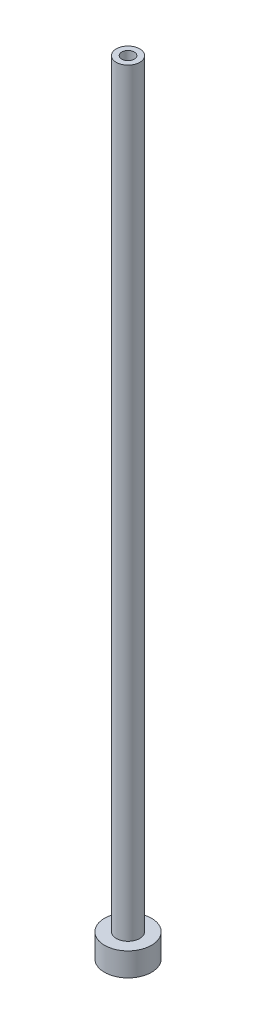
ISO-10303-21;
HEADER;
FILE_DESCRIPTION(('STEP AP214'),'2;1');
FILE_NAME('part.step','',(''),(''),'','','');
FILE_SCHEMA(('AUTOMOTIVE_DESIGN { 1 0 10303 214 1 1 1 1 }'));
ENDSEC;
DATA;
#1=APPLICATION_CONTEXT('core data for automotive mechanical design processes');
#2=APPLICATION_PROTOCOL_DEFINITION('international standard','automotive_design',2000,#1);
#3=PRODUCT_CONTEXT('',#1,'mechanical');
#4=PRODUCT('Part','Part','',(#3));
#5=PRODUCT_RELATED_PRODUCT_CATEGORY('part','',(#4));
#6=PRODUCT_DEFINITION_FORMATION('','',#4);
#7=PRODUCT_DEFINITION_CONTEXT('part definition',#1,'design');
#8=PRODUCT_DEFINITION('design','',#6,#7);
#9=PRODUCT_DEFINITION_SHAPE('','',#8);
#10=(LENGTH_UNIT() NAMED_UNIT(*) SI_UNIT(.MILLI.,.METRE.));
#11=(NAMED_UNIT(*) PLANE_ANGLE_UNIT() SI_UNIT($,.RADIAN.));
#12=(NAMED_UNIT(*) SI_UNIT($,.STERADIAN.) SOLID_ANGLE_UNIT());
#13=UNCERTAINTY_MEASURE_WITH_UNIT(LENGTH_MEASURE(1.E-05),#10,'distance_accuracy_value','');
#14=(GEOMETRIC_REPRESENTATION_CONTEXT(3) GLOBAL_UNCERTAINTY_ASSIGNED_CONTEXT((#13)) GLOBAL_UNIT_ASSIGNED_CONTEXT((#10,
#11,#12)) REPRESENTATION_CONTEXT('',''));
#15=CARTESIAN_POINT('',(0.,0.,0.));
#16=DIRECTION('',(0.,0.,1.));
#17=DIRECTION('',(1.,0.,0.));
#18=AXIS2_PLACEMENT_3D('',#15,#16,#17);
#19=CARTESIAN_POINT('',(0.,0.,0.));
#20=DIRECTION('',(0.,-1.,0.));
#21=DIRECTION('',(0.,0.,-1.));
#22=AXIS2_PLACEMENT_3D('',#19,#20,#21);
#23=CYLINDRICAL_SURFACE('',#22,3.);
#24=CARTESIAN_POINT('',(0.,-3.,0.));
#25=DIRECTION('',(0.,-1.,0.));
#26=DIRECTION('',(0.,0.,-1.));
#27=AXIS2_PLACEMENT_3D('',#24,#25,#26);
#28=CIRCLE('',#27,3.);
#29=CARTESIAN_POINT('',(0.,-3.,-3.));
#30=VERTEX_POINT('',#29);
#31=EDGE_CURVE('E41',#30,#30,#28,.T.);
#32=ORIENTED_EDGE('',*,*,#31,.F.);
#33=EDGE_LOOP('',(#32));
#34=FACE_BOUND('',#33,.T.);
#35=CARTESIAN_POINT('',(0.,0.,0.));
#36=DIRECTION('',(0.,-1.,0.));
#37=DIRECTION('',(0.,0.,-1.));
#38=AXIS2_PLACEMENT_3D('',#35,#36,#37);
#39=CIRCLE('',#38,3.);
#40=CARTESIAN_POINT('',(0.,0.,-3.));
#41=VERTEX_POINT('',#40);
#42=EDGE_CURVE('E8',#41,#41,#39,.T.);
#43=ORIENTED_EDGE('',*,*,#42,.T.);
#44=EDGE_LOOP('',(#43));
#45=FACE_BOUND('',#44,.T.);
#46=ADVANCED_FACE('F13',(#34,#45),#23,.T.);
#47=CARTESIAN_POINT('',(-3.,0.,0.));
#48=DIRECTION('',(0.,-1.,0.));
#49=DIRECTION('',(0.,0.,-1.));
#50=AXIS2_PLACEMENT_3D('',#47,#48,#49);
#51=PLANE('',#50);
#52=ORIENTED_EDGE('',*,*,#42,.F.);
#53=EDGE_LOOP('',(#52));
#54=FACE_BOUND('',#53,.T.);
#55=CARTESIAN_POINT('',(0.,0.,0.));
#56=DIRECTION('',(0.,-1.,0.));
#57=DIRECTION('',(0.,0.,-1.));
#58=AXIS2_PLACEMENT_3D('',#55,#56,#57);
#59=CIRCLE('',#58,1.5);
#60=CARTESIAN_POINT('',(0.,0.,-1.5));
#61=VERTEX_POINT('',#60);
#62=EDGE_CURVE('E19',#61,#61,#59,.T.);
#63=ORIENTED_EDGE('',*,*,#62,.T.);
#64=EDGE_LOOP('',(#63));
#65=FACE_BOUND('',#64,.T.);
#66=ADVANCED_FACE('F48',(#54,#65),#51,.F.);
#67=CARTESIAN_POINT('',(0.,0.,0.));
#68=DIRECTION('',(0.,-1.,0.));
#69=DIRECTION('',(0.,0.,-1.));
#70=AXIS2_PLACEMENT_3D('',#67,#68,#69);
#71=CYLINDRICAL_SURFACE('',#70,1.5);
#72=ORIENTED_EDGE('',*,*,#62,.F.);
#73=EDGE_LOOP('',(#72));
#74=FACE_BOUND('',#73,.T.);
#75=CARTESIAN_POINT('',(0.,97.,0.));
#76=DIRECTION('',(0.,-1.,0.));
#77=DIRECTION('',(0.,0.,-1.));
#78=AXIS2_PLACEMENT_3D('',#75,#76,#77);
#79=CIRCLE('',#78,1.5);
#80=CARTESIAN_POINT('',(0.,97.,-1.5));
#81=VERTEX_POINT('',#80);
#82=EDGE_CURVE('E23',#81,#81,#79,.T.);
#83=ORIENTED_EDGE('',*,*,#82,.T.);
#84=EDGE_LOOP('',(#83));
#85=FACE_BOUND('',#84,.T.);
#86=ADVANCED_FACE('F54',(#74,#85),#71,.T.);
#87=CARTESIAN_POINT('',(-1.5,97.,0.));
#88=DIRECTION('',(0.,-1.,0.));
#89=DIRECTION('',(0.,0.,-1.));
#90=AXIS2_PLACEMENT_3D('',#87,#88,#89);
#91=PLANE('',#90);
#92=ORIENTED_EDGE('',*,*,#82,.F.);
#93=EDGE_LOOP('',(#92));
#94=FACE_BOUND('',#93,.T.);
#95=CARTESIAN_POINT('',(0.,97.,0.));
#96=DIRECTION('',(0.,-1.,0.));
#97=DIRECTION('',(0.,0.,-1.));
#98=AXIS2_PLACEMENT_3D('',#95,#96,#97);
#99=CIRCLE('',#98,0.799999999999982);
#100=CARTESIAN_POINT('',(0.,97.,-0.799999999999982));
#101=VERTEX_POINT('',#100);
#102=EDGE_CURVE('E27',#101,#101,#99,.T.);
#103=ORIENTED_EDGE('',*,*,#102,.T.);
#104=EDGE_LOOP('',(#103));
#105=FACE_BOUND('',#104,.T.);
#106=ADVANCED_FACE('F60',(#94,#105),#91,.F.);
#107=CARTESIAN_POINT('',(0.,0.,0.));
#108=DIRECTION('',(0.,-1.,0.));
#109=DIRECTION('',(0.,0.,-1.));
#110=AXIS2_PLACEMENT_3D('',#107,#108,#109);
#111=CYLINDRICAL_SURFACE('',#110,0.79999999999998);
#112=ORIENTED_EDGE('',*,*,#102,.F.);
#113=EDGE_LOOP('',(#112));
#114=FACE_BOUND('',#113,.T.);
#115=CARTESIAN_POINT('',(0.,62.,0.));
#116=DIRECTION('',(0.,-1.,0.));
#117=DIRECTION('',(0.,0.,-1.));
#118=AXIS2_PLACEMENT_3D('',#115,#116,#117);
#119=CIRCLE('',#118,0.799999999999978);
#120=CARTESIAN_POINT('',(0.,62.,-0.799999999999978));
#121=VERTEX_POINT('',#120);
#122=EDGE_CURVE('E32',#121,#121,#119,.T.);
#123=ORIENTED_EDGE('',*,*,#122,.T.);
#124=EDGE_LOOP('',(#123));
#125=FACE_BOUND('',#124,.T.);
#126=ADVANCED_FACE('F66',(#114,#125),#111,.F.);
#127=CARTESIAN_POINT('',(0.,61.8,0.));
#128=DIRECTION('',(0.,-1.,0.));
#129=DIRECTION('',(0.,0.,-1.));
#130=AXIS2_PLACEMENT_3D('',#127,#128,#129);
#131=CONICAL_SURFACE('',#130,0.999999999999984,0.785398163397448);
#132=ORIENTED_EDGE('',*,*,#122,.F.);
#133=EDGE_LOOP('',(#132));
#134=FACE_BOUND('',#133,.T.);
#135=CARTESIAN_POINT('',(0.,61.8,0.));
#136=DIRECTION('',(0.,-1.,0.));
#137=DIRECTION('',(0.,0.,-1.));
#138=AXIS2_PLACEMENT_3D('',#135,#136,#137);
#139=CIRCLE('',#138,0.999999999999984);
#140=CARTESIAN_POINT('',(0.,61.8,-0.999999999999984));
#141=VERTEX_POINT('',#140);
#142=EDGE_CURVE('E35',#141,#141,#139,.T.);
#143=ORIENTED_EDGE('',*,*,#142,.T.);
#144=EDGE_LOOP('',(#143));
#145=FACE_BOUND('',#144,.T.);
#146=ADVANCED_FACE('F70',(#134,#145),#131,.F.);
#147=CARTESIAN_POINT('',(0.,0.,0.));
#148=DIRECTION('',(0.,-1.,0.));
#149=DIRECTION('',(0.,0.,-1.));
#150=AXIS2_PLACEMENT_3D('',#147,#148,#149);
#151=CYLINDRICAL_SURFACE('',#150,0.99999999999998);
#152=ORIENTED_EDGE('',*,*,#142,.F.);
#153=EDGE_LOOP('',(#152));
#154=FACE_BOUND('',#153,.T.);
#155=CARTESIAN_POINT('',(0.,-3.,0.));
#156=DIRECTION('',(0.,-1.,0.));
#157=DIRECTION('',(0.,0.,-1.));
#158=AXIS2_PLACEMENT_3D('',#155,#156,#157);
#159=CIRCLE('',#158,0.999999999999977);
#160=CARTESIAN_POINT('',(0.,-3.,-0.999999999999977));
#161=VERTEX_POINT('',#160);
#162=EDGE_CURVE('E38',#161,#161,#159,.T.);
#163=ORIENTED_EDGE('',*,*,#162,.T.);
#164=EDGE_LOOP('',(#163));
#165=FACE_BOUND('',#164,.T.);
#166=ADVANCED_FACE('F74',(#154,#165),#151,.F.);
#167=CARTESIAN_POINT('',(-0.999999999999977,-3.,0.));
#168=DIRECTION('',(0.,1.,0.));
#169=DIRECTION('',(0.,0.,1.));
#170=AXIS2_PLACEMENT_3D('',#167,#168,#169);
#171=PLANE('',#170);
#172=ORIENTED_EDGE('',*,*,#162,.F.);
#173=EDGE_LOOP('',(#172));
#174=FACE_BOUND('',#173,.T.);
#175=ORIENTED_EDGE('',*,*,#31,.T.);
#176=EDGE_LOOP('',(#175));
#177=FACE_BOUND('',#176,.T.);
#178=ADVANCED_FACE('F45',(#174,#177),#171,.F.);
#179=CLOSED_SHELL('',(#46,#66,#86,#106,#126,#146,#166,#178));
#180=MANIFOLD_SOLID_BREP('B1',#179);
#181=ADVANCED_BREP_SHAPE_REPRESENTATION('',(#18,#180),#14);
#182=SHAPE_DEFINITION_REPRESENTATION(#9,#181);
ENDSEC;
END-ISO-10303-21;
